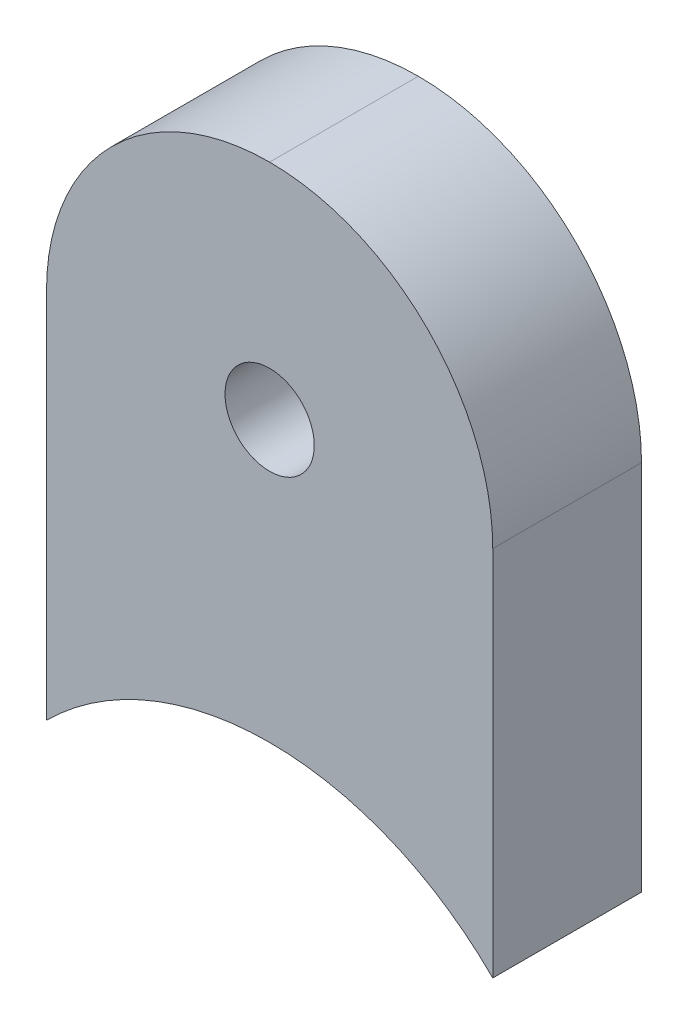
ISO-10303-21;
HEADER;
FILE_DESCRIPTION(('STEP AP214'),'2;1');
FILE_NAME('part.step','',(''),(''),'','','');
FILE_SCHEMA(('AUTOMOTIVE_DESIGN { 1 0 10303 214 1 1 1 1 }'));
ENDSEC;
DATA;
#1=APPLICATION_CONTEXT('core data for automotive mechanical design processes');
#2=APPLICATION_PROTOCOL_DEFINITION('international standard','automotive_design',2000,#1);
#3=PRODUCT_CONTEXT('',#1,'mechanical');
#4=PRODUCT('Part','Part','',(#3));
#5=PRODUCT_RELATED_PRODUCT_CATEGORY('part','',(#4));
#6=PRODUCT_DEFINITION_FORMATION('','',#4);
#7=PRODUCT_DEFINITION_CONTEXT('part definition',#1,'design');
#8=PRODUCT_DEFINITION('design','',#6,#7);
#9=PRODUCT_DEFINITION_SHAPE('','',#8);
#10=(LENGTH_UNIT() NAMED_UNIT(*) SI_UNIT(.MILLI.,.METRE.));
#11=(NAMED_UNIT(*) PLANE_ANGLE_UNIT() SI_UNIT($,.RADIAN.));
#12=(NAMED_UNIT(*) SI_UNIT($,.STERADIAN.) SOLID_ANGLE_UNIT());
#13=UNCERTAINTY_MEASURE_WITH_UNIT(LENGTH_MEASURE(1.E-05),#10,'distance_accuracy_value','');
#14=(GEOMETRIC_REPRESENTATION_CONTEXT(3) GLOBAL_UNCERTAINTY_ASSIGNED_CONTEXT((#13)) GLOBAL_UNIT_ASSIGNED_CONTEXT((#10,
#11,#12)) REPRESENTATION_CONTEXT('',''));
#15=CARTESIAN_POINT('',(0.,0.,0.));
#16=DIRECTION('',(0.,0.,1.));
#17=DIRECTION('',(1.,0.,0.));
#18=AXIS2_PLACEMENT_3D('',#15,#16,#17);
#19=CARTESIAN_POINT('',(-15.,-15.0000000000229,10.));
#20=DIRECTION('',(0.,0.,-1.));
#21=DIRECTION('',(-1.,0.,0.));
#22=AXIS2_PLACEMENT_3D('',#19,#20,#21);
#23=CYLINDRICAL_SURFACE('',#22,21.2132034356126);
#24=CARTESIAN_POINT('',(-15.,-15.0000000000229,0.));
#25=DIRECTION('',(0.,0.,-1.));
#26=DIRECTION('',(-1.,0.,0.));
#27=AXIS2_PLACEMENT_3D('',#24,#25,#26);
#28=CIRCLE('',#27,21.2132034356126);
#29=CARTESIAN_POINT('',(-30.,0.,0.));
#30=VERTEX_POINT('',#29);
#31=CARTESIAN_POINT('',(0.,0.,0.));
#32=VERTEX_POINT('',#31);
#33=EDGE_CURVE('E94',#30,#32,#28,.T.);
#34=ORIENTED_EDGE('',*,*,#33,.T.);
#35=DIRECTION('',(0.,0.,-1.));
#36=VECTOR('',#35,1.);
#37=CARTESIAN_POINT('',(0.,0.,10.));
#38=LINE('',#37,#36);
#39=CARTESIAN_POINT('',(0.,0.,10.));
#40=VERTEX_POINT('',#39);
#41=EDGE_CURVE('E80',#40,#32,#38,.T.);
#42=ORIENTED_EDGE('',*,*,#41,.F.);
#43=CARTESIAN_POINT('',(-15.,-15.0000000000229,10.));
#44=DIRECTION('',(0.,0.,-1.));
#45=DIRECTION('',(-1.,0.,0.));
#46=AXIS2_PLACEMENT_3D('',#43,#44,#45);
#47=CIRCLE('',#46,21.2132034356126);
#48=CARTESIAN_POINT('',(-30.,0.,10.));
#49=VERTEX_POINT('',#48);
#50=EDGE_CURVE('E83',#49,#40,#47,.T.);
#51=ORIENTED_EDGE('',*,*,#50,.F.);
#52=DIRECTION('',(0.,0.,-1.));
#53=VECTOR('',#52,1.);
#54=CARTESIAN_POINT('',(-30.,0.,10.));
#55=LINE('',#54,#53);
#56=EDGE_CURVE('E96',#49,#30,#55,.T.);
#57=ORIENTED_EDGE('',*,*,#56,.T.);
#58=EDGE_LOOP('',(#34,#42,#51,#57));
#59=FACE_BOUND('',#58,.T.);
#60=ADVANCED_FACE('F31',(#59),#23,.F.);
#61=CARTESIAN_POINT('',(0.,40.,10.));
#62=DIRECTION('',(-1.,0.,0.));
#63=DIRECTION('',(0.,0.,1.));
#64=AXIS2_PLACEMENT_3D('',#61,#62,#63);
#65=PLANE('',#64);
#66=DIRECTION('',(0.,1.,0.));
#67=VECTOR('',#66,1.);
#68=CARTESIAN_POINT('',(0.,40.,0.));
#69=LINE('',#68,#67);
#70=CARTESIAN_POINT('',(0.,25.,0.));
#71=VERTEX_POINT('',#70);
#72=EDGE_CURVE('E122',#32,#71,#69,.T.);
#73=ORIENTED_EDGE('',*,*,#72,.T.);
#74=DIRECTION('',(0.,0.,-1.));
#75=VECTOR('',#74,1.);
#76=CARTESIAN_POINT('',(0.,25.,10.));
#77=LINE('',#76,#75);
#78=CARTESIAN_POINT('',(0.,25.,10.));
#79=VERTEX_POINT('',#78);
#80=EDGE_CURVE('E11',#71,#79,#77,.F.);
#81=ORIENTED_EDGE('',*,*,#80,.T.);
#82=DIRECTION('',(0.,1.,0.));
#83=VECTOR('',#82,1.);
#84=CARTESIAN_POINT('',(0.,40.,10.));
#85=LINE('',#84,#83);
#86=EDGE_CURVE('E76',#40,#79,#85,.T.);
#87=ORIENTED_EDGE('',*,*,#86,.F.);
#88=ORIENTED_EDGE('',*,*,#41,.T.);
#89=EDGE_LOOP('',(#73,#81,#87,#88));
#90=FACE_BOUND('',#89,.T.);
#91=ADVANCED_FACE('F78',(#90),#65,.F.);
#92=CARTESIAN_POINT('',(-30.,0.,10.));
#93=DIRECTION('',(1.,0.,0.));
#94=DIRECTION('',(0.,0.,-1.));
#95=AXIS2_PLACEMENT_3D('',#92,#93,#94);
#96=PLANE('',#95);
#97=DIRECTION('',(0.,-1.,0.));
#98=VECTOR('',#97,1.);
#99=CARTESIAN_POINT('',(-30.,0.,10.));
#100=LINE('',#99,#98);
#101=CARTESIAN_POINT('',(-30.,25.,10.));
#102=VERTEX_POINT('',#101);
#103=EDGE_CURVE('E82',#102,#49,#100,.T.);
#104=ORIENTED_EDGE('',*,*,#103,.F.);
#105=DIRECTION('',(0.,0.,-1.));
#106=VECTOR('',#105,1.);
#107=CARTESIAN_POINT('',(-30.,25.,10.));
#108=LINE('',#107,#106);
#109=CARTESIAN_POINT('',(-30.,25.,0.));
#110=VERTEX_POINT('',#109);
#111=EDGE_CURVE('E95',#102,#110,#108,.T.);
#112=ORIENTED_EDGE('',*,*,#111,.T.);
#113=DIRECTION('',(0.,-1.,0.));
#114=VECTOR('',#113,1.);
#115=CARTESIAN_POINT('',(-30.,0.,0.));
#116=LINE('',#115,#114);
#117=EDGE_CURVE('E91',#110,#30,#116,.T.);
#118=ORIENTED_EDGE('',*,*,#117,.T.);
#119=ORIENTED_EDGE('',*,*,#56,.F.);
#120=EDGE_LOOP('',(#104,#112,#118,#119));
#121=FACE_BOUND('',#120,.T.);
#122=ADVANCED_FACE('F113',(#121),#96,.F.);
#123=CARTESIAN_POINT('',(-15.,-15.0000000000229,10.));
#124=DIRECTION('',(0.,0.,-1.));
#125=DIRECTION('',(-1.,0.,0.));
#126=AXIS2_PLACEMENT_3D('',#123,#124,#125);
#127=PLANE('',#126);
#128=CARTESIAN_POINT('',(-15.,25.,10.));
#129=DIRECTION('',(0.,0.,-1.));
#130=DIRECTION('',(-1.,0.,0.));
#131=AXIS2_PLACEMENT_3D('',#128,#129,#130);
#132=CIRCLE('',#131,3.);
#133=CARTESIAN_POINT('',(-18.,25.,10.));
#134=VERTEX_POINT('',#133);
#135=EDGE_CURVE('E121',#134,#134,#132,.T.);
#136=ORIENTED_EDGE('',*,*,#135,.T.);
#137=EDGE_LOOP('',(#136));
#138=FACE_BOUND('',#137,.T.);
#139=CARTESIAN_POINT('',(-15.,25.,10.));
#140=DIRECTION('',(0.,0.,-1.));
#141=DIRECTION('',(-1.,0.,0.));
#142=AXIS2_PLACEMENT_3D('',#139,#140,#141);
#143=CIRCLE('',#142,15.);
#144=CARTESIAN_POINT('',(-15.,40.,10.));
#145=VERTEX_POINT('',#144);
#146=EDGE_CURVE('E47',#79,#145,#143,.F.);
#147=ORIENTED_EDGE('',*,*,#146,.T.);
#148=CARTESIAN_POINT('',(-15.,25.,10.));
#149=DIRECTION('',(0.,0.,-1.));
#150=DIRECTION('',(-1.,0.,0.));
#151=AXIS2_PLACEMENT_3D('',#148,#149,#150);
#152=CIRCLE('',#151,15.);
#153=EDGE_CURVE('E40',#145,#102,#152,.F.);
#154=ORIENTED_EDGE('',*,*,#153,.T.);
#155=ORIENTED_EDGE('',*,*,#103,.T.);
#156=ORIENTED_EDGE('',*,*,#50,.T.);
#157=ORIENTED_EDGE('',*,*,#86,.T.);
#158=EDGE_LOOP('',(#147,#154,#155,#156,#157));
#159=FACE_BOUND('',#158,.T.);
#160=ADVANCED_FACE('F86',(#138,#159),#127,.F.);
#161=CARTESIAN_POINT('',(-15.,-15.0000000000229,0.));
#162=DIRECTION('',(0.,0.,-1.));
#163=DIRECTION('',(-1.,0.,0.));
#164=AXIS2_PLACEMENT_3D('',#161,#162,#163);
#165=PLANE('',#164);
#166=CARTESIAN_POINT('',(-15.,25.,0.));
#167=DIRECTION('',(0.,0.,1.));
#168=DIRECTION('',(1.,0.,0.));
#169=AXIS2_PLACEMENT_3D('',#166,#167,#168);
#170=CIRCLE('',#169,3.);
#171=CARTESIAN_POINT('',(-12.,25.,0.));
#172=VERTEX_POINT('',#171);
#173=EDGE_CURVE('E125',#172,#172,#170,.T.);
#174=ORIENTED_EDGE('',*,*,#173,.T.);
#175=EDGE_LOOP('',(#174));
#176=FACE_BOUND('',#175,.T.);
#177=ORIENTED_EDGE('',*,*,#117,.F.);
#178=CARTESIAN_POINT('',(-15.,25.,0.));
#179=DIRECTION('',(0.,0.,-1.));
#180=DIRECTION('',(-1.,0.,0.));
#181=AXIS2_PLACEMENT_3D('',#178,#179,#180);
#182=CIRCLE('',#181,15.);
#183=CARTESIAN_POINT('',(-15.,40.,0.));
#184=VERTEX_POINT('',#183);
#185=EDGE_CURVE('E105',#110,#184,#182,.T.);
#186=ORIENTED_EDGE('',*,*,#185,.T.);
#187=CARTESIAN_POINT('',(-15.,25.,0.));
#188=DIRECTION('',(0.,0.,-1.));
#189=DIRECTION('',(-1.,0.,0.));
#190=AXIS2_PLACEMENT_3D('',#187,#188,#189);
#191=CIRCLE('',#190,15.);
#192=EDGE_CURVE('E99',#184,#71,#191,.T.);
#193=ORIENTED_EDGE('',*,*,#192,.T.);
#194=ORIENTED_EDGE('',*,*,#72,.F.);
#195=ORIENTED_EDGE('',*,*,#33,.F.);
#196=EDGE_LOOP('',(#177,#186,#193,#194,#195));
#197=FACE_BOUND('',#196,.T.);
#198=ADVANCED_FACE('F119',(#176,#197),#165,.T.);
#199=CARTESIAN_POINT('',(-15.,25.,10.));
#200=DIRECTION('',(0.,0.,-1.));
#201=DIRECTION('',(-1.,0.,0.));
#202=AXIS2_PLACEMENT_3D('',#199,#200,#201);
#203=CYLINDRICAL_SURFACE('',#202,15.);
#204=DIRECTION('',(0.,0.,-1.));
#205=VECTOR('',#204,1.);
#206=CARTESIAN_POINT('',(-15.,40.,10.));
#207=LINE('',#206,#205);
#208=EDGE_CURVE('E35',#145,#184,#207,.T.);
#209=ORIENTED_EDGE('',*,*,#208,.F.);
#210=ORIENTED_EDGE('',*,*,#146,.F.);
#211=ORIENTED_EDGE('',*,*,#80,.F.);
#212=ORIENTED_EDGE('',*,*,#192,.F.);
#213=EDGE_LOOP('',(#209,#210,#211,#212));
#214=FACE_BOUND('',#213,.T.);
#215=ADVANCED_FACE('F33',(#214),#203,.T.);
#216=CARTESIAN_POINT('',(-15.,25.,10.));
#217=DIRECTION('',(0.,0.,-1.));
#218=DIRECTION('',(-1.,0.,0.));
#219=AXIS2_PLACEMENT_3D('',#216,#217,#218);
#220=CYLINDRICAL_SURFACE('',#219,15.);
#221=ORIENTED_EDGE('',*,*,#153,.F.);
#222=ORIENTED_EDGE('',*,*,#208,.T.);
#223=ORIENTED_EDGE('',*,*,#185,.F.);
#224=ORIENTED_EDGE('',*,*,#111,.F.);
#225=EDGE_LOOP('',(#221,#222,#223,#224));
#226=FACE_BOUND('',#225,.T.);
#227=ADVANCED_FACE('F116',(#226),#220,.T.);
#228=CARTESIAN_POINT('',(-15.,25.,0.));
#229=DIRECTION('',(0.,0.,1.));
#230=DIRECTION('',(1.,0.,0.));
#231=AXIS2_PLACEMENT_3D('',#228,#229,#230);
#232=CYLINDRICAL_SURFACE('',#231,3.);
#233=ORIENTED_EDGE('',*,*,#173,.F.);
#234=EDGE_LOOP('',(#233));
#235=FACE_BOUND('',#234,.T.);
#236=ORIENTED_EDGE('',*,*,#135,.F.);
#237=EDGE_LOOP('',(#236));
#238=FACE_BOUND('',#237,.T.);
#239=ADVANCED_FACE('F135',(#235,#238),#232,.F.);
#240=CLOSED_SHELL('',(#60,#91,#122,#160,#198,#215,#227,#239));
#241=MANIFOLD_SOLID_BREP('B2',#240);
#242=ADVANCED_BREP_SHAPE_REPRESENTATION('',(#18,#241),#14);
#243=SHAPE_DEFINITION_REPRESENTATION(#9,#242);
ENDSEC;
END-ISO-10303-21;
